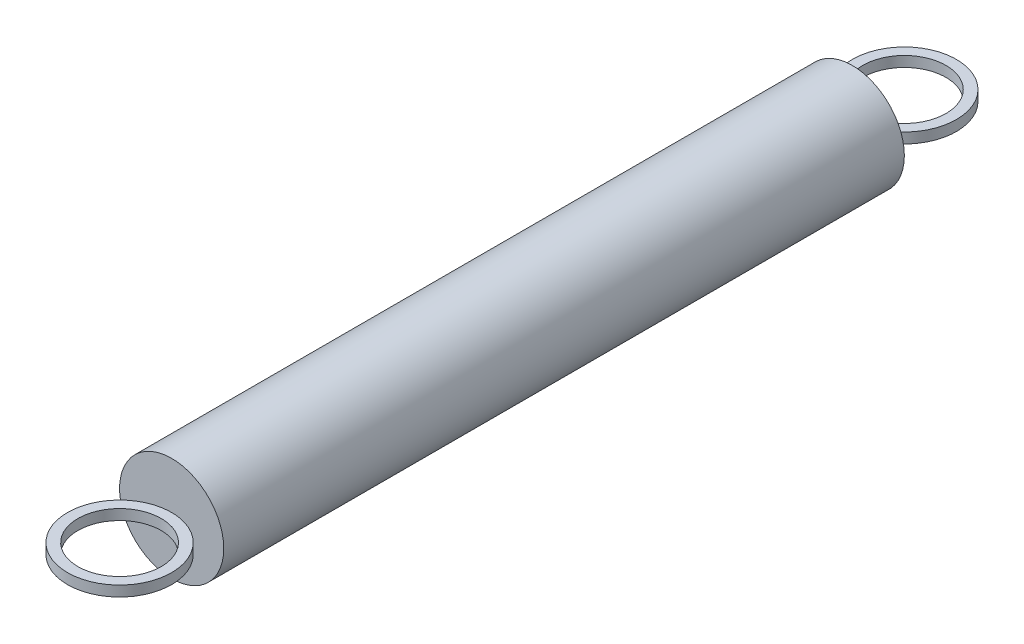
from build123d import *

# Parameters (mm, degrees)
SKETCH1_R        = 2.286
EXTRUDE1_DEPTH   = 14.9352
SKETCH2_R        = 2.286
SKETCH2_R_2      = 1.8288
EXTRUDE2_DEPTH   = 0.2286
EXTRUDE2_2_DEPTH = 0.2286


with BuildPart() as part:
    # Sketch1 → Extrude1 (new, symmetric)
    with BuildSketch(Plane.XY):
        Circle(SKETCH1_R)
    extrude(amount=EXTRUDE1_DEPTH, both=True)


with BuildPart() as body_2:
    # Sketch2 → Extrude2 (new, symmetric)
    with BuildSketch(Plane(origin=(0, 0, 0), x_dir=(1, 0, 0), z_dir=(0, 1, 0))):
        with Locations(Location((0, 17.2212, 0), (0, 0, 270))):
            Circle(SKETCH2_R)
        with Locations(Location((0, 17.2212, 0), (0, 0, 270))):
            Circle(SKETCH2_R_2, mode=Mode.SUBTRACT)
    extrude(amount=EXTRUDE2_DEPTH, both=True)


with BuildPart() as body_3:
    # Sketch2 → Extrude2 2 (new, symmetric)
    with BuildSketch(Plane(origin=(0, 0, 0), x_dir=(1, 0, 0), z_dir=(0, 1, 0))):
        with Locations(Location((0, -17.2212, 0), (0, 0, 270))):
            Circle(SKETCH2_R)
        with Locations(Location((0, -17.2212, 0), (0, 0, 270))):
            Circle(SKETCH2_R_2, mode=Mode.SUBTRACT)
    extrude(amount=EXTRUDE2_2_DEPTH, both=True)


solid = Compound([part.part, body_2.part, body_3.part])
